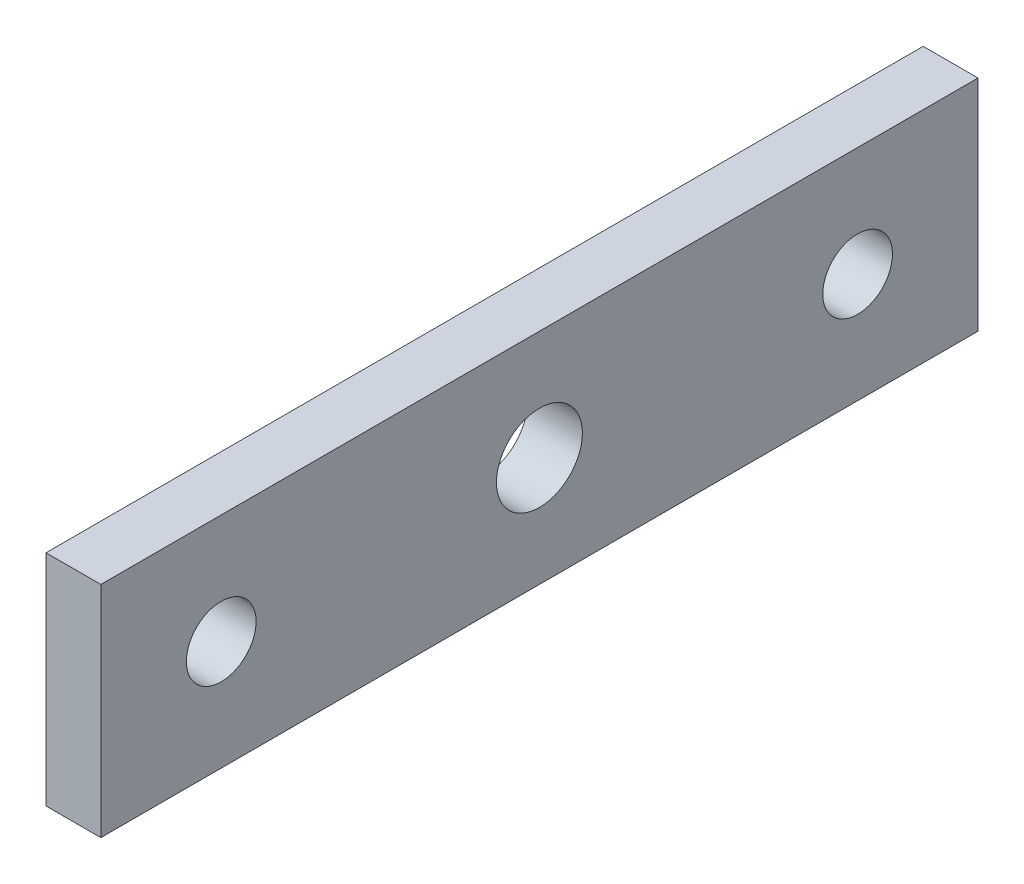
from build123d import *

# Parameters (mm, degrees)
SKETCH1_W           = 50.8
SKETCH1_H           = 12.7
SKETCH1_R           = 2.0193
SKETCH1_R_2         = 2.4892
BOSS_EXTRUDE1_DEPTH = 3.175


with BuildPart() as part:
    # Sketch1 → Boss-Extrude1 (new body)
    with BuildSketch(Plane(origin=(0, 0, 0), x_dir=(0, 0, -1), z_dir=(1, 0, 0))):
        with Locations((25.4, -6.35)):
            Rectangle(SKETCH1_W, SKETCH1_H)
        with Locations((6.9723, -6.35)):
            Circle(SKETCH1_R, mode=Mode.SUBTRACT)
        with Locations((43.8277, -6.35)):
            Circle(SKETCH1_R, mode=Mode.SUBTRACT)
        with Locations((25.4, -6.35)):
            Circle(SKETCH1_R_2, mode=Mode.SUBTRACT)
    extrude(amount=BOSS_EXTRUDE1_DEPTH)


solid = part.part
